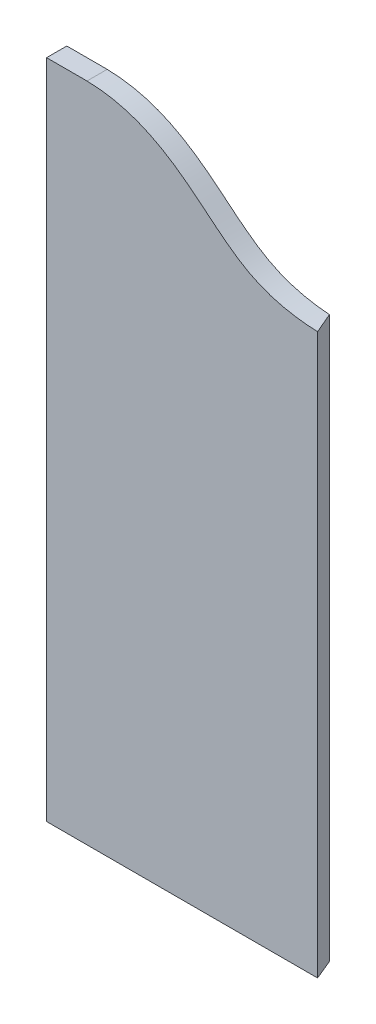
ISO-10303-21;
HEADER;
FILE_DESCRIPTION(('STEP AP214'),'2;1');
FILE_NAME('part.step','',(''),(''),'','','');
FILE_SCHEMA(('AUTOMOTIVE_DESIGN { 1 0 10303 214 1 1 1 1 }'));
ENDSEC;
DATA;
#1=APPLICATION_CONTEXT('core data for automotive mechanical design processes');
#2=APPLICATION_PROTOCOL_DEFINITION('international standard','automotive_design',2000,#1);
#3=PRODUCT_CONTEXT('',#1,'mechanical');
#4=PRODUCT('Part','Part','',(#3));
#5=PRODUCT_RELATED_PRODUCT_CATEGORY('part','',(#4));
#6=PRODUCT_DEFINITION_FORMATION('','',#4);
#7=PRODUCT_DEFINITION_CONTEXT('part definition',#1,'design');
#8=PRODUCT_DEFINITION('design','',#6,#7);
#9=PRODUCT_DEFINITION_SHAPE('','',#8);
#10=(LENGTH_UNIT() NAMED_UNIT(*) SI_UNIT(.MILLI.,.METRE.));
#11=(NAMED_UNIT(*) PLANE_ANGLE_UNIT() SI_UNIT($,.RADIAN.));
#12=(NAMED_UNIT(*) SI_UNIT($,.STERADIAN.) SOLID_ANGLE_UNIT());
#13=UNCERTAINTY_MEASURE_WITH_UNIT(LENGTH_MEASURE(1.E-05),#10,'distance_accuracy_value','');
#14=(GEOMETRIC_REPRESENTATION_CONTEXT(3) GLOBAL_UNCERTAINTY_ASSIGNED_CONTEXT((#13)) GLOBAL_UNIT_ASSIGNED_CONTEXT((#10,
#11,#12)) REPRESENTATION_CONTEXT('',''));
#15=CARTESIAN_POINT('',(0.,0.,0.));
#16=DIRECTION('',(0.,0.,1.));
#17=DIRECTION('',(1.,0.,0.));
#18=AXIS2_PLACEMENT_3D('',#15,#16,#17);
#19=CARTESIAN_POINT('',(25.4,831.85,0.));
#20=DIRECTION('',(1.,0.,0.));
#21=DIRECTION('',(0.,0.,-1.));
#22=AXIS2_PLACEMENT_3D('',#19,#20,#21);
#23=PLANE('',#22);
#24=DIRECTION('',(0.,0.,1.));
#25=VECTOR('',#24,1.);
#26=CARTESIAN_POINT('',(25.4,0.,0.));
#27=LINE('',#26,#25);
#28=CARTESIAN_POINT('',(25.4,0.,-25.4));
#29=VERTEX_POINT('',#28);
#30=CARTESIAN_POINT('',(25.4,0.,0.));
#31=VERTEX_POINT('',#30);
#32=EDGE_CURVE('E90',#29,#31,#27,.T.);
#33=ORIENTED_EDGE('',*,*,#32,.T.);
#34=DIRECTION('',(0.,-1.,0.));
#35=VECTOR('',#34,1.);
#36=CARTESIAN_POINT('',(25.4,831.85,0.));
#37=LINE('',#36,#35);
#38=CARTESIAN_POINT('',(25.4,831.85,0.));
#39=VERTEX_POINT('',#38);
#40=EDGE_CURVE('E11',#39,#31,#37,.T.);
#41=ORIENTED_EDGE('',*,*,#40,.F.);
#42=DIRECTION('',(0.,0.,1.));
#43=VECTOR('',#42,1.);
#44=CARTESIAN_POINT('',(25.4,831.85,0.));
#45=LINE('',#44,#43);
#46=CARTESIAN_POINT('',(25.4,831.85,-25.4));
#47=VERTEX_POINT('',#46);
#48=EDGE_CURVE('E84',#47,#39,#45,.T.);
#49=ORIENTED_EDGE('',*,*,#48,.F.);
#50=DIRECTION('',(0.,-1.,0.));
#51=VECTOR('',#50,1.);
#52=CARTESIAN_POINT('',(25.4,831.85,-25.4));
#53=LINE('',#52,#51);
#54=EDGE_CURVE('E76',#47,#29,#53,.T.);
#55=ORIENTED_EDGE('',*,*,#54,.T.);
#56=EDGE_LOOP('',(#33,#41,#49,#55));
#57=FACE_BOUND('',#56,.T.);
#58=ADVANCED_FACE('F32',(#57),#23,.F.);
#59=CARTESIAN_POINT('',(25.4,831.85,0.));
#60=DIRECTION('',(0.,0.,-1.));
#61=DIRECTION('',(-1.,0.,0.));
#62=AXIS2_PLACEMENT_3D('',#59,#60,#61);
#63=PLANE('',#62);
#64=DIRECTION('',(0.,-1.,0.));
#65=VECTOR('',#64,1.);
#66=CARTESIAN_POINT('',(366.121024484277,831.85,0.));
#67=LINE('',#66,#65);
#68=CARTESIAN_POINT('',(366.121024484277,703.815722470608,0.));
#69=VERTEX_POINT('',#68);
#70=CARTESIAN_POINT('',(366.121024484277,0.,0.));
#71=VERTEX_POINT('',#70);
#72=EDGE_CURVE('E39',#69,#71,#67,.T.);
#73=ORIENTED_EDGE('',*,*,#72,.F.);
#74=CARTESIAN_POINT('',(76.2,831.85,0.));
#75=CARTESIAN_POINT('',(128.999459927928,830.674563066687,0.));
#76=CARTESIAN_POINT('',(194.062378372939,796.089213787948,0.));
#77=CARTESIAN_POINT('',(274.942141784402,718.711008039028,0.));
#78=CARTESIAN_POINT('',(331.762606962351,705.272502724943,0.));
#79=CARTESIAN_POINT('',(366.121024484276,703.815722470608,0.));
#80=B_SPLINE_CURVE_WITH_KNOTS('',3,(#74,#75,#76,#77,#78,#79),.UNSPECIFIED.,.F.,.F.,(4,1,1,4),
(0.,0.428785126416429,0.716530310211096,1.),.UNSPECIFIED.);
#81=CARTESIAN_POINT('',(76.2,831.85,0.));
#82=VERTEX_POINT('',#81);
#83=EDGE_CURVE('E116',#82,#69,#80,.T.);
#84=ORIENTED_EDGE('',*,*,#83,.F.);
#85=DIRECTION('',(1.,0.,0.));
#86=VECTOR('',#85,1.);
#87=CARTESIAN_POINT('',(25.4,831.85,0.));
#88=LINE('',#87,#86);
#89=EDGE_CURVE('E113',#39,#82,#88,.T.);
#90=ORIENTED_EDGE('',*,*,#89,.F.);
#91=ORIENTED_EDGE('',*,*,#40,.T.);
#92=DIRECTION('',(1.,0.,0.));
#93=VECTOR('',#92,1.);
#94=CARTESIAN_POINT('',(25.4,0.,0.));
#95=LINE('',#94,#93);
#96=EDGE_CURVE('E94',#31,#71,#95,.T.);
#97=ORIENTED_EDGE('',*,*,#96,.T.);
#98=EDGE_LOOP('',(#73,#84,#90,#91,#97));
#99=FACE_BOUND('',#98,.T.);
#100=ADVANCED_FACE('F111',(#99),#63,.F.);
#101=CARTESIAN_POINT('',(366.121024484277,831.85,0.));
#102=DIRECTION('',(-0.923879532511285,0.,0.382683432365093));
#103=DIRECTION('',(0.382683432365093,0.,0.923879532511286));
#104=AXIS2_PLACEMENT_3D('',#101,#102,#103);
#105=PLANE('',#104);
#106=DIRECTION('',(0.,-1.,0.));
#107=VECTOR('',#106,1.);
#108=CARTESIAN_POINT('',(355.6,831.85,-25.4));
#109=LINE('',#108,#107);
#110=CARTESIAN_POINT('',(355.600000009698,704.441797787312,-25.4));
#111=VERTEX_POINT('',#110);
#112=CARTESIAN_POINT('',(355.6,0.,-25.4));
#113=VERTEX_POINT('',#112);
#114=EDGE_CURVE('E79',#111,#113,#109,.T.);
#115=ORIENTED_EDGE('',*,*,#114,.F.);
#116=CARTESIAN_POINT('',(355.6,704.441797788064,-25.4));
#117=CARTESIAN_POINT('',(356.038304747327,704.407833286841,-24.3418387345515));
#118=CARTESIAN_POINT('',(356.476621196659,704.374902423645,-23.2836492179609));
#119=CARTESIAN_POINT('',(357.353271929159,704.311071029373,-21.1672271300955));
#120=CARTESIAN_POINT('',(357.791606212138,704.280170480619,-20.1089945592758));
#121=CARTESIAN_POINT('',(358.668292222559,704.220362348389,-17.9924873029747));
#122=CARTESIAN_POINT('',(359.10664394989,704.191454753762,-16.9342126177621));
#123=CARTESIAN_POINT('',(359.98336448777,704.135595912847,-14.8176220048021));
#124=CARTESIAN_POINT('',(360.42173329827,704.108644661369,-13.7593060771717));
#125=CARTESIAN_POINT('',(361.298487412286,704.05666245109,-11.6426344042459));
#126=CARTESIAN_POINT('',(361.736872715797,704.031631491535,-10.5842786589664));
#127=CARTESIAN_POINT('',(362.613659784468,703.983454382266,-8.46752742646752));
#128=CARTESIAN_POINT('',(363.052061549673,703.960308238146,-7.40913193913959));
#129=CARTESIAN_POINT('',(363.928881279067,703.91586583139,-5.292301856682));
#130=CARTESIAN_POINT('',(364.367299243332,703.894569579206,-4.23386726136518));
#131=CARTESIAN_POINT('',(365.244151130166,703.853792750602,-2.11695954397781));
#132=CARTESIAN_POINT('',(365.682585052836,703.834312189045,-1.05848642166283));
#133=CARTESIAN_POINT('',(366.121024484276,703.815722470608,0.));
#134=B_SPLINE_CURVE_WITH_KNOTS('',3,(#116,#117,#118,#119,#120,#121,#122,#123,#124,#125,#126,
#127,#128,#129,#130,#131,#132,#133),.UNSPECIFIED.,.F.,.F.,(4,2,2,2,2,2,2,2,4),(0.,
3.43754638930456,6.87506284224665,10.3125600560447,13.7500481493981,17.1875348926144,
20.6250318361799,24.0625481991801,27.5000926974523),.UNSPECIFIED.);
#135=EDGE_CURVE('E95',#111,#69,#134,.T.);
#136=ORIENTED_EDGE('',*,*,#135,.T.);
#137=ORIENTED_EDGE('',*,*,#72,.T.);
#138=DIRECTION('',(-0.382683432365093,0.,-0.923879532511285));
#139=VECTOR('',#138,1.);
#140=CARTESIAN_POINT('',(366.121024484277,0.,0.));
#141=LINE('',#140,#139);
#142=EDGE_CURVE('E85',#71,#113,#141,.T.);
#143=ORIENTED_EDGE('',*,*,#142,.T.);
#144=EDGE_LOOP('',(#115,#136,#137,#143));
#145=FACE_BOUND('',#144,.T.);
#146=ADVANCED_FACE('F107',(#145),#105,.F.);
#147=CARTESIAN_POINT('',(25.4,831.85,-25.4));
#148=DIRECTION('',(0.,0.,1.));
#149=DIRECTION('',(1.,0.,0.));
#150=AXIS2_PLACEMENT_3D('',#147,#148,#149);
#151=PLANE('',#150);
#152=DIRECTION('',(-1.,0.,0.));
#153=VECTOR('',#152,1.);
#154=CARTESIAN_POINT('',(25.4,831.85,-25.4));
#155=LINE('',#154,#153);
#156=CARTESIAN_POINT('',(76.2,831.85,-25.4));
#157=VERTEX_POINT('',#156);
#158=EDGE_CURVE('E54',#157,#47,#155,.T.);
#159=ORIENTED_EDGE('',*,*,#158,.F.);
#160=CARTESIAN_POINT('',(76.2,831.85,-25.4));
#161=CARTESIAN_POINT('',(128.999459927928,830.674563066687,-25.4));
#162=CARTESIAN_POINT('',(194.062378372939,796.089213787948,-25.4));
#163=CARTESIAN_POINT('',(274.942141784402,718.711008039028,-25.4));
#164=CARTESIAN_POINT('',(331.762606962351,705.272502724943,-25.4));
#165=CARTESIAN_POINT('',(366.121024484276,703.815722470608,-25.4));
#166=B_SPLINE_CURVE_WITH_KNOTS('',3,(#160,#161,#162,#163,#164,#165),.UNSPECIFIED.,.F.,.F.,(4,1,
1,4),(0.,0.428785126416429,0.716530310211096,1.),.UNSPECIFIED.);
#167=EDGE_CURVE('E46',#157,#111,#166,.T.);
#168=ORIENTED_EDGE('',*,*,#167,.T.);
#169=ORIENTED_EDGE('',*,*,#114,.T.);
#170=DIRECTION('',(-1.,0.,0.));
#171=VECTOR('',#170,1.);
#172=CARTESIAN_POINT('',(25.4,0.,-25.4));
#173=LINE('',#172,#171);
#174=EDGE_CURVE('E73',#113,#29,#173,.T.);
#175=ORIENTED_EDGE('',*,*,#174,.T.);
#176=ORIENTED_EDGE('',*,*,#54,.F.);
#177=EDGE_LOOP('',(#159,#168,#169,#175,#176));
#178=FACE_BOUND('',#177,.T.);
#179=ADVANCED_FACE('F75',(#178),#151,.F.);
#180=CARTESIAN_POINT('',(0.,831.85,0.));
#181=DIRECTION('',(0.,-1.,0.));
#182=DIRECTION('',(0.,0.,-1.));
#183=AXIS2_PLACEMENT_3D('',#180,#181,#182);
#184=PLANE('',#183);
#185=ORIENTED_EDGE('',*,*,#89,.T.);
#186=DIRECTION('',(0.,0.,1.));
#187=VECTOR('',#186,1.);
#188=CARTESIAN_POINT('',(76.2,831.85,-25.4));
#189=LINE('',#188,#187);
#190=EDGE_CURVE('E99',#157,#82,#189,.T.);
#191=ORIENTED_EDGE('',*,*,#190,.F.);
#192=ORIENTED_EDGE('',*,*,#158,.T.);
#193=ORIENTED_EDGE('',*,*,#48,.T.);
#194=EDGE_LOOP('',(#185,#191,#192,#193));
#195=FACE_BOUND('',#194,.T.);
#196=ADVANCED_FACE('F117',(#195),#184,.F.);
#197=CARTESIAN_POINT('',(0.,0.,0.));
#198=DIRECTION('',(0.,-1.,0.));
#199=DIRECTION('',(0.,0.,-1.));
#200=AXIS2_PLACEMENT_3D('',#197,#198,#199);
#201=PLANE('',#200);
#202=ORIENTED_EDGE('',*,*,#32,.F.);
#203=ORIENTED_EDGE('',*,*,#174,.F.);
#204=ORIENTED_EDGE('',*,*,#142,.F.);
#205=ORIENTED_EDGE('',*,*,#96,.F.);
#206=EDGE_LOOP('',(#202,#203,#204,#205));
#207=FACE_BOUND('',#206,.T.);
#208=ADVANCED_FACE('F92',(#207),#201,.T.);
#209=DIRECTION('',(0.,0.,1.));
#210=VECTOR('',#209,1.);
#211=SURFACE_OF_LINEAR_EXTRUSION('',#166,#210);
#212=ORIENTED_EDGE('',*,*,#167,.F.);
#213=ORIENTED_EDGE('',*,*,#190,.T.);
#214=ORIENTED_EDGE('',*,*,#83,.T.);
#215=ORIENTED_EDGE('',*,*,#135,.F.);
#216=EDGE_LOOP('',(#212,#213,#214,#215));
#217=FACE_BOUND('',#216,.T.);
#218=ADVANCED_FACE('F128',(#217),#211,.F.);
#219=CLOSED_SHELL('',(#58,#100,#146,#179,#196,#208,#218));
#220=MANIFOLD_SOLID_BREP('B2',#219);
#221=ADVANCED_BREP_SHAPE_REPRESENTATION('',(#18,#220),#14);
#222=SHAPE_DEFINITION_REPRESENTATION(#9,#221);
ENDSEC;
END-ISO-10303-21;
